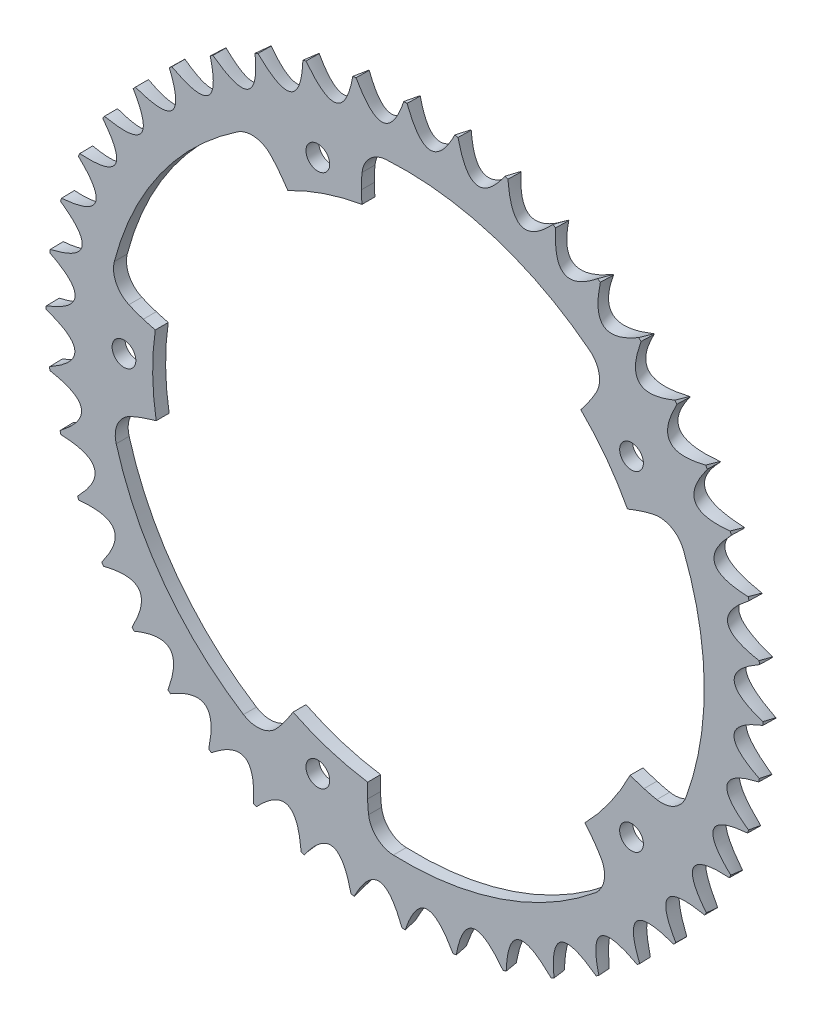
from build123d import *

# Parameters (mm, degrees)
EXTRUDE1_DEPTH    = 3
CIRPATTERN1_COUNT = 5
CIRPATTERN2_COUNT = 44
FILLET1_R         = 6


with BuildPart() as part:
    # Sketch1 → Extrude1 (new body)
    with BuildSketch(Plane.XY):
        with BuildLine():
            ThreePointArc((211.503902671, 382.280297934), (223.092456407, 409.600260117), (245.028687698, 429.587172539))
            ThreePointArc((245.028687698, 429.587172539), (237.549099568, 433.622306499), (229.220935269, 435.315889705))
            ThreePointArc((229.220935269, 435.315889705), (212.017554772, 417.448669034), (200.860587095, 395.296559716))
            ThreePointArc((200.860587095, 395.296559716), (205.218216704, 388.000149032), (211.503902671, 382.280297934))
        make_face()
        with BuildLine():
            ThreePointArc((245.028687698, 429.587172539), (257.512228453, 435.233627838), (270.861436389, 438.319060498))
            ThreePointArc((270.861436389, 438.319060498), (274.358954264, 446.064634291), (279.951671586, 452.463701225))
            ThreePointArc((279.951671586, 452.463701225), (275.163866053, 452.337280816), (270.391319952, 451.934953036))
            ThreePointArc((270.391319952, 451.934953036), (255.448413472, 442.765246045), (237.986812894, 441.194741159))
            ThreePointArc((237.986812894, 441.194741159), (233.510346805, 438.394772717), (229.220935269, 435.315889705))
            ThreePointArc((229.220935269, 435.315889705), (237.549099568, 433.622306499), (245.028687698, 429.587172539))
        make_face()
        with BuildLine():
            ThreePointArc((237.986812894, 441.194741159), (255.448413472, 442.765246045), (270.391319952, 451.934953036))
            ThreePointArc((270.391319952, 451.934953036), (253.631011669, 448.248565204), (237.986812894, 441.194741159))
        make_face()
        with BuildLine():
            ThreePointArc((270.861436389, 438.319060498), (300.425324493, 435.740023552), (326.212676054, 421.053723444))
            ThreePointArc((326.212676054, 421.053723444), (327.738996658, 429.414159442), (326.776145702, 437.85806036))
            ThreePointArc((326.776145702, 437.85806036), (304.467272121, 448.698172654), (279.951671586, 452.463701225))
            ThreePointArc((279.951671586, 452.463701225), (274.358954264, 446.064634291), (270.861436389, 438.319060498))
        make_face()
        with BuildLine():
            ThreePointArc((326.212676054, 421.053723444), (335.440400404, 410.926021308), (342.499953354, 399.18362124))
            ThreePointArc((342.499953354, 399.18362124), (350.947224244, 398.250798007), (358.761343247, 394.909228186))
            ThreePointArc((358.761343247, 394.909228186), (357.161597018, 399.423635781), (355.30416271, 403.838270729))
            ThreePointArc((355.30416271, 403.838270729), (341.965641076, 415.216224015), (335.076070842, 431.33788033))
            ThreePointArc((335.076070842, 431.33788033), (331.029838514, 434.730014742), (326.776145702, 437.85806036))
            ThreePointArc((326.776145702, 437.85806036), (327.738996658, 429.414159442), (326.212676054, 421.053723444))
        make_face()
        with BuildLine():
            ThreePointArc((335.076070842, 431.33788033), (341.965641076, 415.216224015), (355.30416271, 403.838270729))
            ThreePointArc((355.30416271, 403.838270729), (346.61897945, 418.639114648), (335.076070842, 431.33788033))
        make_face()
        with BuildLine():
            ThreePointArc((269.760501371, 429.836044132), (269.996468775, 434.118368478), (270.861436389, 438.319060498))
            ThreePointArc((270.861436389, 438.319060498), (257.512228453, 435.233627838), (245.028687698, 429.587172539))
            ThreePointArc((245.028687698, 429.587172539), (248.082693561, 426.954919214), (250.74211004, 423.924537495))
            ThreePointArc((250.74211004, 423.924537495), (251.751410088, 422.559195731), (252.72167312, 421.165842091))
            ThreePointArc((252.72167312, 421.165842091), (261.076523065, 424.734083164), (269.883974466, 426.962235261))
            ThreePointArc((269.883974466, 426.962235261), (269.805013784, 428.398399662), (269.760501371, 429.836044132))
        make_face()
        with BuildLine():
            ThreePointArc((320.580778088, 411.134925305), (326.556167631, 404.291637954), (331.396918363, 396.603790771))
            ThreePointArc((331.396918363, 396.603790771), (332.738391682, 397.122686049), (334.091917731, 397.609276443))
            ThreePointArc((334.091917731, 397.609276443), (338.237568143, 398.708169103), (342.499953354, 399.18362124))
            ThreePointArc((342.499953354, 399.18362124), (335.440400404, 410.926021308), (326.212676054, 421.053723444))
            ThreePointArc((326.212676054, 421.053723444), (324.65299409, 417.335780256), (322.592734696, 413.870085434))
            ThreePointArc((322.592734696, 413.870085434), (321.606108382, 412.488270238), (320.580778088, 411.134925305))
        make_face()
        with BuildLine():
            ThreePointArc((335.233446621, 342.429084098), (333.614377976, 342.940417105), (332.010425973, 343.497357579))
            ThreePointArc((332.010425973, 343.497357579), (327.348569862, 335.699732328), (321.532866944, 328.720229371))
            ThreePointArc((321.532866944, 328.720229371), (322.440903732, 327.604759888), (323.321941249, 326.46784482))
            ThreePointArc((323.321941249, 326.46784482), (325.648126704, 322.864673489), (327.417458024, 318.957827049))
            ThreePointArc((327.417458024, 318.957827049), (336.403622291, 329.300462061), (343.184115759, 341.206181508))
            ThreePointArc((343.184115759, 341.206181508), (339.166173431, 341.540619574), (335.233446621, 342.429084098))
        make_face()
        with BuildLine():
            ThreePointArc((359.340111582, 345.863115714), (351.6070219, 342.338081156), (343.184115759, 341.206181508))
            ThreePointArc((343.184115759, 341.206181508), (336.403622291, 329.300462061), (327.417458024, 318.957827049))
            ThreePointArc((327.417458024, 318.957827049), (329.140640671, 310.635736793), (328.377314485, 302.171466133))
            ThreePointArc((328.377314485, 302.171466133), (332.176422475, 305.087943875), (335.801011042, 308.218666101))
            ThreePointArc((335.801011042, 308.218666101), (342.500257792, 324.420334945), (355.703869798, 335.954571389))
            ThreePointArc((355.703869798, 335.954571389), (357.679626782, 340.850994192), (359.340111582, 345.863115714))
        make_face()
        with BuildLine():
            ThreePointArc((335.801011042, 308.218666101), (347.193580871, 321.052478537), (355.703869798, 335.954571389))
            ThreePointArc((355.703869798, 335.954571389), (342.500257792, 324.420334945), (335.801011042, 308.218666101))
        make_face()
        with BuildLine():
            ThreePointArc((358.761343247, 394.909228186), (350.947224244, 398.250798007), (342.499953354, 399.18362124))
            ThreePointArc((342.499953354, 399.18362124), (347.49515161, 384.688413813), (349.187721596, 369.450361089))
            ThreePointArc((349.187721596, 369.450361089), (347.670239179, 355.012762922), (343.184115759, 341.206181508))
            ThreePointArc((343.184115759, 341.206181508), (351.6070219, 342.338081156), (359.340111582, 345.863115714))
            ThreePointArc((359.340111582, 345.863115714), (361.90179687, 357.533304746), (362.761629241, 369.450361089))
            ThreePointArc((362.761629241, 369.450361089), (361.755460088, 382.335975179), (358.761343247, 394.909228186))
        make_face()
        with BuildLine():
            ThreePointArc((328.377314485, 302.171466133), (329.140640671, 310.635736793), (327.417458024, 318.957827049))
            ThreePointArc((327.417458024, 318.957827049), (301.983850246, 303.667094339), (272.489053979, 300.391135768))
            ThreePointArc((272.489053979, 300.391135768), (276.168375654, 292.730252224), (281.910538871, 286.464942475))
            ThreePointArc((281.910538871, 286.464942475), (306.330454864, 290.807934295), (328.377314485, 302.171466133))
        make_face()
        with BuildLine():
            ThreePointArc((246.457446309, 308.510998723), (259.070754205, 303.160698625), (272.489053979, 300.391135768))
            ThreePointArc((272.489053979, 300.391135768), (271.565511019, 304.315773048), (271.195211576, 308.330569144))
            ThreePointArc((271.195211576, 308.330569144), (271.181198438, 310.028405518), (271.215231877, 311.725958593))
            ThreePointArc((271.215231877, 311.725958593), (262.358656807, 313.750048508), (253.923604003, 317.124325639))
            ThreePointArc((253.923604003, 317.124325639), (253.143328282, 315.916032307), (252.334313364, 314.726789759))
            ThreePointArc((252.334313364, 314.726789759), (249.626324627, 311.401014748), (246.457446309, 308.510998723))
        make_face()
        with BuildLine():
            ThreePointArc((281.910538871, 286.464942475), (276.168375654, 292.730252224), (272.489053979, 300.391135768))
            ThreePointArc((272.489053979, 300.391135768), (259.070754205, 303.160698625), (246.457446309, 308.510998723))
            ThreePointArc((246.457446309, 308.510998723), (239.075160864, 304.30048732), (230.789280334, 302.410850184))
            ThreePointArc((230.789280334, 302.410850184), (234.737004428, 299.698924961), (238.834557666, 297.219182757))
            ThreePointArc((238.834557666, 297.219182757), (256.31344149, 295.854411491), (271.363292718, 286.861305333))
            ThreePointArc((271.363292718, 286.861305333), (276.630610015, 286.495326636), (281.910538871, 286.464942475))
        make_face()
        with BuildLine():
            ThreePointArc((238.834557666, 297.219182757), (254.560736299, 290.350071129), (271.363292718, 286.861305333))
            ThreePointArc((271.363292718, 286.861305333), (256.31344149, 295.854411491), (238.834557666, 297.219182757))
        make_face()
        with BuildLine():
            ThreePointArc((230.789280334, 302.410850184), (239.075160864, 304.30048732), (246.457446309, 308.510998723))
            ThreePointArc((246.457446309, 308.510998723), (224.055678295, 327.974700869), (211.825663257, 355.013592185))
            ThreePointArc((211.825663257, 355.013592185), (205.676702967, 349.147006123), (201.492465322, 341.74979719))
            ThreePointArc((201.492465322, 341.74979719), (213.169065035, 319.867135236), (230.789280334, 302.410850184))
        make_face()
        with BuildLine():
            ThreePointArc((211.825663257, 355.013592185), (210.313191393, 368.630995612), (211.503902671, 382.280297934))
            ThreePointArc((211.503902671, 382.280297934), (205.218216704, 388.000149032), (200.860587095, 395.296559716))
            ThreePointArc((200.860587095, 395.296559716), (199.501306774, 390.704020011), (198.409145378, 386.04073282))
            ThreePointArc((198.409145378, 386.04073282), (202.512442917, 368.995588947), (198.610150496, 351.903307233))
            ThreePointArc((198.610150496, 351.903307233), (199.889774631, 346.780697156), (201.492465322, 341.74979719))
            ThreePointArc((201.492465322, 341.74979719), (205.676702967, 349.147006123), (211.825663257, 355.013592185))
        make_face()
        with BuildLine():
            ThreePointArc((198.610150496, 351.903307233), (202.512442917, 368.995588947), (198.409145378, 386.04073282))
            ThreePointArc((198.409145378, 386.04073282), (196.735888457, 368.961575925), (198.610150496, 351.903307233))
        make_face()
        with BuildLine():
            ThreePointArc((219.231523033, 378.611850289), (215.231708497, 380.159579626), (211.503902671, 382.280297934))
            ThreePointArc((211.503902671, 382.280297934), (210.313191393, 368.630995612), (211.825663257, 355.013592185))
            ThreePointArc((211.825663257, 355.013592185), (215.272824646, 357.104713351), (218.976693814, 358.697529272))
            ThreePointArc((218.976693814, 358.697529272), (220.587101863, 359.235516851), (222.212087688, 359.727721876))
            ThreePointArc((222.212087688, 359.727721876), (221.400279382, 368.776303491), (222.002832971, 377.841224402))
            ThreePointArc((222.002832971, 377.841224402), (220.612559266, 378.209927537), (219.231523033, 378.611850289))
        make_face()
    extrude(amount=EXTRUDE1_DEPTH)

    # Sketch3 → M5 Clearance Hole1 (revolve, cut)
    with BuildSketch(Plane(origin=(332.334143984, 407.656402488, 3), x_dir=(0, -1, 0), z_dir=(1, 0, 0))):
        Polygon((0, 0), (0, 11.652366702), (2.75, 10), (2.75, 0), align=None)
    m5_clearance_hole1 = revolve(axis=Axis((332.334143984, 407.656402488, 9.35), (0, 0, -1)), mode=Mode.SUBTRACT)

    # CirPattern1: M5 Clearance Hole1 ×5 about axis
    cirpattern1_axis = Axis((279.748039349, 369.450361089, 0), (0, 0, 1))
    for i in range(1, CIRPATTERN1_COUNT):
        add(m5_clearance_hole1.rotate(cirpattern1_axis, i * 360 / CIRPATTERN1_COUNT), mode=Mode.SUBTRACT)

    # Sketch6 for Cut-Loft1 → Cut-Loft1 section 0
    with BuildSketch(Plane(origin=(0, 0, 0), x_dir=(-1, 0, 0), z_dir=(0, 0, -1))):
        with BuildLine():
            # circular arc as an exact rational Bezier (weights 1, cos(half-angle), 1)
            Bezier((-280.084047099, 453.96031433), (-286.72744437, 455.771400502), (-292.922122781, 452.764621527), weights=[1, 0.936243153, 1])
            add(Edge.make_bspline(
                [(-280.084047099, 453.96031433), (-283.078044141, 437.831184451), (-292.922122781, 452.764621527)],
                knots=[0, 0, 0, 1, 1, 1], degree=2))
        make_face()
    # Sketch5 for Cut-Loft1 → Cut-Loft1 section 1
    with BuildSketch(Plane.XY.offset(3)):
        with BuildLine():
            Bezier((279.748039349, 454.064934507), (286.091798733, 455.83358297), (292.112342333, 453.16441545), weights=[1, 0.941210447, 1])
            add(Edge.make_bspline(
                [(279.748039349, 454.064934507), (285.231680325, 437.946606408), (292.112342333, 453.16441545)],
                knots=[0, 0, 0, 1, 1, 1], degree=2))
        make_face()
    cut_loft1 = loft(mode=Mode.SUBTRACT)

    # CirPattern2: Cut-Loft1 ×44 about axis
    cirpattern2_axis = Axis((279.748039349, 369.450361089, 3), (0, 0, -1))
    for i in range(1, CIRPATTERN2_COUNT):
        add(cut_loft1.rotate(cirpattern2_axis, i * 360 / CIRPATTERN2_COUNT), mode=Mode.SUBTRACT)

    # Fillet1
    fillet1_edges = [part.edges().sort_by_distance(p)[0] for p in [
        (211.503902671, 382.280297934, 1.5),
        (211.825663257, 355.013592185, 1.5),
        (246.457446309, 308.510998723, 1.5),
        (272.489053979, 300.391135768, 1.5),
        (327.417458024, 318.957827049, 1.5),
        (343.184115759, 341.206181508, 1.5),
        (342.499953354, 399.18362124, 1.5),
        (326.212676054, 421.053723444, 1.5),
        (270.861436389, 438.319060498, 1.5),
        (245.028687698, 429.587172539, 1.5),
    ]]
    fillet(fillet1_edges, radius=FILLET1_R)


solid = part.part
